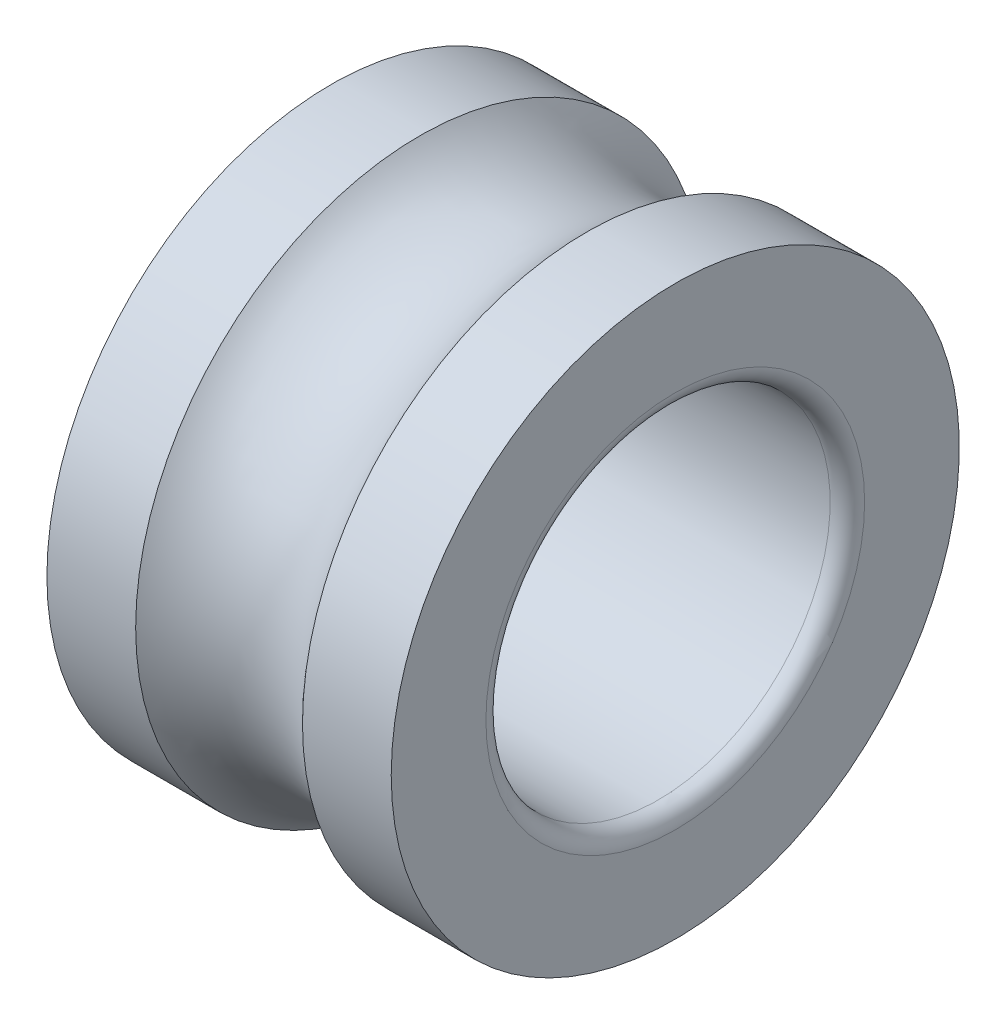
from build123d import *


with BuildPart() as part:
    # Esquisse1 → Base-R_volution (revolve)
    with BuildSketch(Plane(origin=(0, 0, 0), x_dir=(1, 0, 0), z_dir=(0, 1, 0)), mode=Mode.PRIVATE) as base_r_volution_sk:
        with BuildLine():
            Line((0, 4.95), (0, 3.3))
            ThreePointArc((0, 3.3), (0.087867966, 3.087867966), (0.3, 3))
            Line((0.3, 3), (5.7, 3))
            ThreePointArc((5.7, 3), (5.912132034, 3.087867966), (6, 3.3))
            Line((6, 3.3), (6, 4.95))
            Line((6, 4.95), (4.453444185, 4.95))
            ThreePointArc((4.453444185, 4.95), (3, 4.3), (1.546555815, 4.95))
            Line((1.546555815, 4.95), (0, 4.95))
        make_face()
    revolve(base_r_volution_sk.sketch.rotate(Axis((0, 0, 0), (1, 0, 0)), 180), axis=Axis((0, 0, 0), (1, 0, 0)))


solid = part.part
